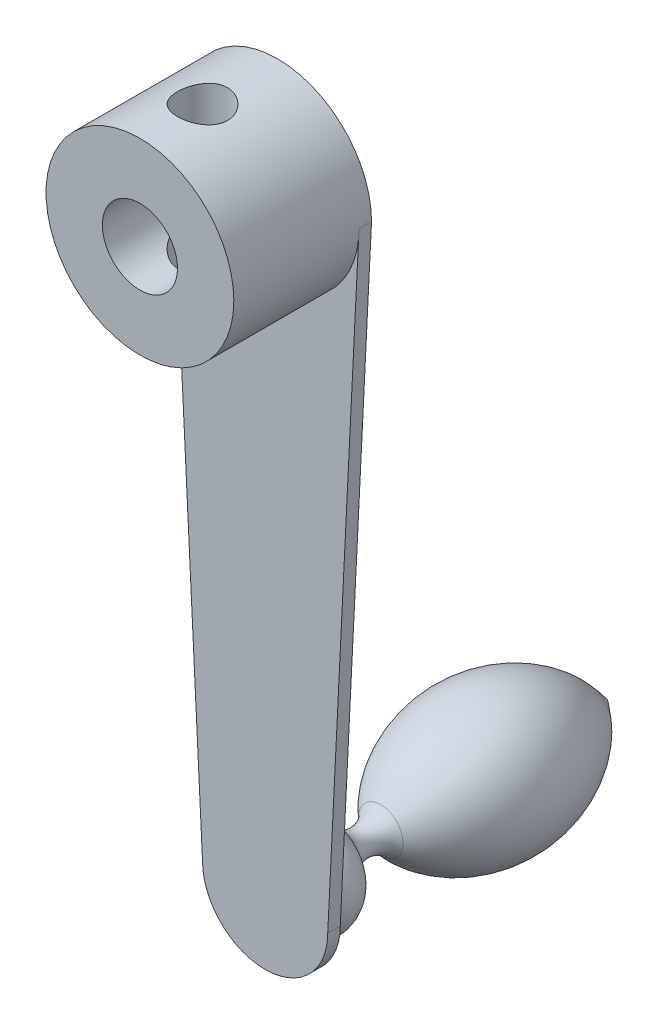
ISO-10303-21;
HEADER;
FILE_DESCRIPTION(('STEP AP214'),'2;1');
FILE_NAME('part.step','',(''),(''),'','','');
FILE_SCHEMA(('AUTOMOTIVE_DESIGN { 1 0 10303 214 1 1 1 1 }'));
ENDSEC;
DATA;
#1=APPLICATION_CONTEXT('core data for automotive mechanical design processes');
#2=APPLICATION_PROTOCOL_DEFINITION('international standard','automotive_design',2000,#1);
#3=PRODUCT_CONTEXT('',#1,'mechanical');
#4=PRODUCT('Part','Part','',(#3));
#5=PRODUCT_RELATED_PRODUCT_CATEGORY('part','',(#4));
#6=PRODUCT_DEFINITION_FORMATION('','',#4);
#7=PRODUCT_DEFINITION_CONTEXT('part definition',#1,'design');
#8=PRODUCT_DEFINITION('design','',#6,#7);
#9=PRODUCT_DEFINITION_SHAPE('','',#8);
#10=(LENGTH_UNIT() NAMED_UNIT(*) SI_UNIT(.MILLI.,.METRE.));
#11=(NAMED_UNIT(*) PLANE_ANGLE_UNIT() SI_UNIT($,.RADIAN.));
#12=(NAMED_UNIT(*) SI_UNIT($,.STERADIAN.) SOLID_ANGLE_UNIT());
#13=UNCERTAINTY_MEASURE_WITH_UNIT(LENGTH_MEASURE(1.E-05),#10,'distance_accuracy_value','');
#14=(GEOMETRIC_REPRESENTATION_CONTEXT(3) GLOBAL_UNCERTAINTY_ASSIGNED_CONTEXT((#13)) GLOBAL_UNIT_ASSIGNED_CONTEXT((#10,
#11,#12)) REPRESENTATION_CONTEXT('',''));
#15=CARTESIAN_POINT('',(0.,0.,0.));
#16=DIRECTION('',(0.,0.,1.));
#17=DIRECTION('',(1.,0.,0.));
#18=AXIS2_PLACEMENT_3D('',#15,#16,#17);
#19=CARTESIAN_POINT('',(0.,50.,0.));
#20=DIRECTION('',(0.,0.,1.));
#21=DIRECTION('',(1.,0.,0.));
#22=AXIS2_PLACEMENT_3D('',#19,#20,#21);
#23=PLANE('',#22);
#24=CARTESIAN_POINT('',(0.,50.,0.));
#25=DIRECTION('',(0.,0.,1.));
#26=DIRECTION('',(1.,0.,0.));
#27=AXIS2_PLACEMENT_3D('',#24,#25,#26);
#28=CIRCLE('',#27,3.);
#29=CARTESIAN_POINT('',(3.,50.,0.));
#30=VERTEX_POINT('',#29);
#31=EDGE_CURVE('E169',#30,#30,#28,.T.);
#32=ORIENTED_EDGE('',*,*,#31,.T.);
#33=EDGE_LOOP('',(#32));
#34=FACE_BOUND('',#33,.T.);
#35=CARTESIAN_POINT('',(0.,50.,0.));
#36=DIRECTION('',(0.,0.,1.));
#37=DIRECTION('',(1.,0.,0.));
#38=AXIS2_PLACEMENT_3D('',#35,#36,#37);
#39=CIRCLE('',#38,7.5);
#40=CARTESIAN_POINT('',(7.5,50.,0.));
#41=VERTEX_POINT('',#40);
#42=CARTESIAN_POINT('',(-7.5,50.,0.));
#43=VERTEX_POINT('',#42);
#44=EDGE_CURVE('E141',#41,#43,#39,.T.);
#45=ORIENTED_EDGE('',*,*,#44,.F.);
#46=DIRECTION('',(0.0499376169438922,0.998752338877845,0.));
#47=VECTOR('',#46,1.);
#48=CARTESIAN_POINT('',(7.5,50.,0.));
#49=LINE('',#48,#47);
#50=CARTESIAN_POINT('',(5.,0.,0.));
#51=VERTEX_POINT('',#50);
#52=EDGE_CURVE('E75',#51,#41,#49,.T.);
#53=ORIENTED_EDGE('',*,*,#52,.F.);
#54=CARTESIAN_POINT('',(0.,0.,0.));
#55=DIRECTION('',(0.,0.,1.));
#56=DIRECTION('',(1.,0.,0.));
#57=AXIS2_PLACEMENT_3D('',#54,#55,#56);
#58=CIRCLE('',#57,5.);
#59=CARTESIAN_POINT('',(-5.,0.,0.));
#60=VERTEX_POINT('',#59);
#61=EDGE_CURVE('E140',#60,#51,#58,.T.);
#62=ORIENTED_EDGE('',*,*,#61,.F.);
#63=DIRECTION('',(0.0499376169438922,-0.998752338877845,0.));
#64=VECTOR('',#63,1.);
#65=CARTESIAN_POINT('',(-7.5,50.,0.));
#66=LINE('',#65,#64);
#67=EDGE_CURVE('E132',#43,#60,#66,.T.);
#68=ORIENTED_EDGE('',*,*,#67,.F.);
#69=EDGE_LOOP('',(#45,#53,#62,#68));
#70=FACE_BOUND('',#69,.T.);
#71=CARTESIAN_POINT('',(0.,0.,0.));
#72=DIRECTION('',(0.,0.,1.));
#73=DIRECTION('',(1.,0.,0.));
#74=AXIS2_PLACEMENT_3D('',#71,#72,#73);
#75=CIRCLE('',#74,3.08331917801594);
#76=CARTESIAN_POINT('',(3.08331917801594,0.,0.));
#77=VERTEX_POINT('',#76);
#78=EDGE_CURVE('E11',#77,#77,#75,.F.);
#79=ORIENTED_EDGE('',*,*,#78,.F.);
#80=EDGE_LOOP('',(#79));
#81=FACE_BOUND('',#80,.T.);
#82=ADVANCED_FACE('F31',(#34,#70,#81),#23,.F.);
#83=CARTESIAN_POINT('',(0.,50.,1.));
#84=DIRECTION('',(0.,0.,-1.));
#85=DIRECTION('',(-1.,0.,0.));
#86=AXIS2_PLACEMENT_3D('',#83,#84,#85);
#87=CYLINDRICAL_SURFACE('',#86,7.5);
#88=CARTESIAN_POINT('',(0.,57.5,4.));
#89=CARTESIAN_POINT('',(-0.110254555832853,57.4999983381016,4.00000261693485));
#90=CARTESIAN_POINT('',(-0.220537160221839,57.4975448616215,4.00914761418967));
#91=CARTESIAN_POINT('',(-0.437925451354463,57.4879957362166,4.04542123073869));
#92=CARTESIAN_POINT('',(-0.545029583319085,57.4808978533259,4.07255850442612));
#93=CARTESIAN_POINT('',(-0.752891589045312,57.4628433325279,4.14387166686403));
#94=CARTESIAN_POINT('',(-0.853657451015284,57.4518916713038,4.18802558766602));
#95=CARTESIAN_POINT('',(-1.04635368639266,57.4272869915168,4.29203724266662));
#96=CARTESIAN_POINT('',(-1.13828347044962,57.4136337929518,4.35189602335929));
#97=CARTESIAN_POINT('',(-1.31282950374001,57.3847461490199,4.48708351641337));
#98=CARTESIAN_POINT('',(-1.39521168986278,57.3694846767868,4.56270866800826));
#99=CARTESIAN_POINT('',(-1.54628713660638,57.3392740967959,4.72664848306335));
#100=CARTESIAN_POINT('',(-1.61497863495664,57.3243250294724,4.81496477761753));
#101=CARTESIAN_POINT('',(-1.73786409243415,57.2961553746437,5.00364823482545));
#102=CARTESIAN_POINT('',(-1.79178877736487,57.2829688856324,5.10419632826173));
#103=CARTESIAN_POINT('',(-1.88187548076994,57.2602147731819,5.31334011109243));
#104=CARTESIAN_POINT('',(-1.91804077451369,57.2506464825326,5.42193431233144));
#105=CARTESIAN_POINT('',(-1.97076920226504,57.236491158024,5.64149553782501));
#106=CARTESIAN_POINT('',(-1.98775670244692,57.2317964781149,5.75235353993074));
#107=CARTESIAN_POINT('',(-2.0029703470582,57.2275983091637,5.97543768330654));
#108=CARTESIAN_POINT('',(-2.00119999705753,57.2280938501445,6.08766356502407));
#109=CARTESIAN_POINT('',(-1.97928510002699,57.2341237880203,6.30698541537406));
#110=CARTESIAN_POINT('',(-1.95965406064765,57.2395173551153,6.41413718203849));
#111=CARTESIAN_POINT('',(-1.90339748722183,57.2545101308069,6.62356833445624));
#112=CARTESIAN_POINT('',(-1.86677059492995,57.2641096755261,6.72584733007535));
#113=CARTESIAN_POINT('',(-1.77714356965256,57.2865566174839,6.92396814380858));
#114=CARTESIAN_POINT('',(-1.72396341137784,57.299439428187,7.01972433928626));
#115=CARTESIAN_POINT('',(-1.60286503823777,57.3269822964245,7.20113415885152));
#116=CARTESIAN_POINT('',(-1.53494392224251,57.3416427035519,7.28678578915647));
#117=CARTESIAN_POINT('',(-1.38366607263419,57.3716751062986,7.4484889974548));
#118=CARTESIAN_POINT('',(-1.29987812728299,57.3870547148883,7.52413631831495));
#119=CARTESIAN_POINT('',(-1.12061766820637,57.4163638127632,7.66038878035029));
#120=CARTESIAN_POINT('',(-1.02514469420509,57.4302932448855,7.72099332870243));
#121=CARTESIAN_POINT('',(-0.82459825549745,57.4552182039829,7.82561790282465));
#122=CARTESIAN_POINT('',(-0.719484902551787,57.4662007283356,7.86956477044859));
#123=CARTESIAN_POINT('',(-0.503002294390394,57.48390044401,7.93904718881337));
#124=CARTESIAN_POINT('',(-0.391634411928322,57.4906185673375,7.96458676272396));
#125=CARTESIAN_POINT('',(-0.169254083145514,57.4988915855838,7.99589487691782));
#126=CARTESIAN_POINT('',(-0.0583242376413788,57.5005899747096,8.00221303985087));
#127=CARTESIAN_POINT('',(0.1630100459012,57.4990447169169,7.99641683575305));
#128=CARTESIAN_POINT('',(0.273414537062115,57.4958015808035,7.98430437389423));
#129=CARTESIAN_POINT('',(0.488602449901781,57.4848303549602,7.94244155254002));
#130=CARTESIAN_POINT('',(0.593449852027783,57.4771802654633,7.91299775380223));
#131=CARTESIAN_POINT('',(0.796706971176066,57.4582629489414,7.83766405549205));
#132=CARTESIAN_POINT('',(0.895115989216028,57.4469953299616,7.79177237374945));
#133=CARTESIAN_POINT('',(1.08483847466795,57.4217566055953,7.68382611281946));
#134=CARTESIAN_POINT('',(1.17597518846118,57.4077368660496,7.62147253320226));
#135=CARTESIAN_POINT('',(1.34668463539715,57.3786145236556,7.48274836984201));
#136=CARTESIAN_POINT('',(1.42625507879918,57.3635117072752,7.40637501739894));
#137=CARTESIAN_POINT('',(1.57388924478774,57.333397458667,7.23921442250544));
#138=CARTESIAN_POINT('',(1.64156519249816,57.3184006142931,7.14808143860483));
#139=CARTESIAN_POINT('',(1.76067191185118,57.2906644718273,6.95543530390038));
#140=CARTESIAN_POINT('',(1.81210336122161,57.2779250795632,6.8539225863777));
#141=CARTESIAN_POINT('',(1.89687411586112,57.2562926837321,6.6439046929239));
#142=CARTESIAN_POINT('',(1.93031812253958,57.2473774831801,6.53544418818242));
#143=CARTESIAN_POINT('',(1.97841205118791,57.234398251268,6.31416068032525));
#144=CARTESIAN_POINT('',(1.99306677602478,57.2303329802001,6.20133879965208));
#145=CARTESIAN_POINT('',(2.00288989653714,57.2276174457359,5.9785052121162));
#146=CARTESIAN_POINT('',(1.99868155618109,57.2287939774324,5.86852267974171));
#147=CARTESIAN_POINT('',(1.97234376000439,57.2360239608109,5.65089648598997));
#148=CARTESIAN_POINT('',(1.95021476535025,57.2420772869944,5.54325276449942));
#149=CARTESIAN_POINT('',(1.88902515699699,57.2582757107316,5.33414424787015));
#150=CARTESIAN_POINT('',(1.8500966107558,57.2683888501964,5.23263815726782));
#151=CARTESIAN_POINT('',(1.75651554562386,57.2915681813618,5.03752116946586));
#152=CARTESIAN_POINT('',(1.70186056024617,57.3046348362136,4.94391151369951));
#153=CARTESIAN_POINT('',(1.57648909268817,57.3327292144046,4.76426964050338));
#154=CARTESIAN_POINT('',(1.50534729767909,57.3478033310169,4.67854146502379));
#155=CARTESIAN_POINT('',(1.349830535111,57.3779550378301,4.52003754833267));
#156=CARTESIAN_POINT('',(1.26545235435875,57.3930326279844,4.44726496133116));
#157=CARTESIAN_POINT('',(1.08367998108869,57.4218781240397,4.31520776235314));
#158=CARTESIAN_POINT('',(0.98604596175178,57.4356111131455,4.25624498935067));
#159=CARTESIAN_POINT('',(0.78188864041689,57.459838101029,4.15566258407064));
#160=CARTESIAN_POINT('',(0.675371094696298,57.4703341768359,4.1140318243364));
#161=CARTESIAN_POINT('',(0.474374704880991,57.4855475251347,4.05472471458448));
#162=CARTESIAN_POINT('',(0.380762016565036,57.490927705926,4.0342506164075));
#163=CARTESIAN_POINT('',(0.191439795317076,57.4981544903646,4.00688779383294));
#164=CARTESIAN_POINT('',(0.0957304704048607,57.5000014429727,3.99999772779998));
#165=CARTESIAN_POINT('',(0.,57.5,4.));
#166=B_SPLINE_CURVE_WITH_KNOTS('',3,(#88,#89,#90,#91,#92,#93,#94,#95,#96,#97,#98,#99,#100,#101,
#102,#103,#104,#105,#106,#107,#108,#109,#110,#111,#112,#113,#114,#115,#116,#117,#118,#119,#120,
#121,#122,#123,#124,#125,#126,#127,#128,#129,#130,#131,#132,#133,#134,#135,#136,#137,#138,#139,
#140,#141,#142,#143,#144,#145,#146,#147,#148,#149,#150,#151,#152,#153,#154,#155,#156,#157,#158,
#159,#160,#161,#162,#163,#164,#165),.UNSPECIFIED.,.T.,.F.,(4,2,2,2,2,2,2,2,2,2,2,2,2,2,2,2,2,2,
2,2,2,2,2,2,2,2,2,2,2,2,2,2,2,2,2,2,2,2,4),(0.,0.330412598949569,0.66098424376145,
0.991130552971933,1.32129886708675,1.65834897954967,1.99544244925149,2.33832582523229,
2.681145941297,3.01622158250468,3.3512346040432,3.67691002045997,4.0026114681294,
4.33198673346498,4.6614268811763,5.00161259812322,5.34181171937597,5.68348809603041,
6.02508977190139,6.35682717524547,6.68853028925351,7.01453535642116,7.34057575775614,
7.6730028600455,8.00549568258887,8.34736496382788,8.68921998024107,9.02906297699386,
9.36881908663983,9.69743342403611,10.0260393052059,10.352107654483,10.67822717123,
11.0139433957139,11.3497412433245,11.692722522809,12.0354832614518,12.3223981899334,
12.6092847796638),.UNSPECIFIED.);
#167=CARTESIAN_POINT('',(0.,57.5,4.));
#168=VERTEX_POINT('',#167);
#169=EDGE_CURVE('E173',#168,#168,#166,.T.);
#170=ORIENTED_EDGE('',*,*,#169,.F.);
#171=EDGE_LOOP('',(#170));
#172=FACE_BOUND('',#171,.T.);
#173=CARTESIAN_POINT('',(0.,50.,11.));
#174=DIRECTION('',(0.,0.,1.));
#175=DIRECTION('',(1.,0.,0.));
#176=AXIS2_PLACEMENT_3D('',#173,#174,#175);
#177=CIRCLE('',#176,7.5);
#178=CARTESIAN_POINT('',(7.5,50.,11.));
#179=VERTEX_POINT('',#178);
#180=EDGE_CURVE('E166',#179,#179,#177,.T.);
#181=ORIENTED_EDGE('',*,*,#180,.F.);
#182=EDGE_LOOP('',(#181));
#183=FACE_BOUND('',#182,.T.);
#184=ORIENTED_EDGE('',*,*,#44,.T.);
#185=DIRECTION('',(0.,0.,-1.));
#186=VECTOR('',#185,1.);
#187=CARTESIAN_POINT('',(-7.5,50.,1.));
#188=LINE('',#187,#186);
#189=CARTESIAN_POINT('',(-7.5,50.,1.));
#190=VERTEX_POINT('',#189);
#191=EDGE_CURVE('E136',#190,#43,#188,.T.);
#192=ORIENTED_EDGE('',*,*,#191,.F.);
#193=CARTESIAN_POINT('',(0.,50.,1.));
#194=DIRECTION('',(0.,0.,1.));
#195=DIRECTION('',(1.,0.,0.));
#196=AXIS2_PLACEMENT_3D('',#193,#194,#195);
#197=CIRCLE('',#196,7.5);
#198=CARTESIAN_POINT('',(-7.46259351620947,49.2518703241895,1.));
#199=VERTEX_POINT('',#198);
#200=EDGE_CURVE('E163',#190,#199,#197,.T.);
#201=ORIENTED_EDGE('',*,*,#200,.T.);
#202=CARTESIAN_POINT('',(7.46259351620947,49.2518703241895,1.));
#203=VERTEX_POINT('',#202);
#204=EDGE_CURVE('E40',#199,#203,#197,.T.);
#205=ORIENTED_EDGE('',*,*,#204,.T.);
#206=CARTESIAN_POINT('',(7.5,50.,1.));
#207=VERTEX_POINT('',#206);
#208=EDGE_CURVE('E160',#203,#207,#197,.T.);
#209=ORIENTED_EDGE('',*,*,#208,.T.);
#210=DIRECTION('',(0.,0.,-1.));
#211=VECTOR('',#210,1.);
#212=CARTESIAN_POINT('',(7.5,50.,1.));
#213=LINE('',#212,#211);
#214=EDGE_CURVE('E55',#207,#41,#213,.T.);
#215=ORIENTED_EDGE('',*,*,#214,.T.);
#216=EDGE_LOOP('',(#184,#192,#201,#205,#209,#215));
#217=FACE_BOUND('',#216,.T.);
#218=CARTESIAN_POINT('',(0.,42.5,4.));
#219=CARTESIAN_POINT('',(0.110254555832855,42.5000016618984,4.00000261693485));
#220=CARTESIAN_POINT('',(0.220537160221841,42.5024551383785,4.00914761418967));
#221=CARTESIAN_POINT('',(0.437925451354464,42.5120042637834,4.04542123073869));
#222=CARTESIAN_POINT('',(0.545029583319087,42.5191021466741,4.07255850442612));
#223=CARTESIAN_POINT('',(0.752891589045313,42.5371566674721,4.14387166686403));
#224=CARTESIAN_POINT('',(0.853657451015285,42.5481083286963,4.18802558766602));
#225=CARTESIAN_POINT('',(1.04635368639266,42.5727130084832,4.29203724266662));
#226=CARTESIAN_POINT('',(1.13828347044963,42.5863662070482,4.35189602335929));
#227=CARTESIAN_POINT('',(1.31282950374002,42.6152538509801,4.48708351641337));
#228=CARTESIAN_POINT('',(1.39521168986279,42.6305153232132,4.56270866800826));
#229=CARTESIAN_POINT('',(1.54628713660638,42.6607259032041,4.72664848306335));
#230=CARTESIAN_POINT('',(1.61497863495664,42.6756749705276,4.81496477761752));
#231=CARTESIAN_POINT('',(1.73786409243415,42.7038446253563,5.00364823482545));
#232=CARTESIAN_POINT('',(1.79178877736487,42.7170311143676,5.10419632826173));
#233=CARTESIAN_POINT('',(1.88187548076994,42.7397852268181,5.31334011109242));
#234=CARTESIAN_POINT('',(1.91804077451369,42.7493535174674,5.42193431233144));
#235=CARTESIAN_POINT('',(1.97076920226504,42.763508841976,5.64149553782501));
#236=CARTESIAN_POINT('',(1.98775670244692,42.7682035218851,5.75235353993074));
#237=CARTESIAN_POINT('',(2.0029703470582,42.7724016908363,5.97543768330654));
#238=CARTESIAN_POINT('',(2.00119999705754,42.7719061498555,6.08766356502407));
#239=CARTESIAN_POINT('',(1.97928510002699,42.7658762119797,6.30698541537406));
#240=CARTESIAN_POINT('',(1.95965406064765,42.7604826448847,6.41413718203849));
#241=CARTESIAN_POINT('',(1.90339748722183,42.7454898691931,6.62356833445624));
#242=CARTESIAN_POINT('',(1.86677059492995,42.7358903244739,6.72584733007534));
#243=CARTESIAN_POINT('',(1.77714356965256,42.7134433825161,6.92396814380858));
#244=CARTESIAN_POINT('',(1.72396341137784,42.700560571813,7.01972433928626));
#245=CARTESIAN_POINT('',(1.60286503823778,42.6730177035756,7.20113415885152));
#246=CARTESIAN_POINT('',(1.53494392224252,42.6583572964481,7.28678578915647));
#247=CARTESIAN_POINT('',(1.38366607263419,42.6283248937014,7.4484889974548));
#248=CARTESIAN_POINT('',(1.29987812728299,42.6129452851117,7.52413631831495));
#249=CARTESIAN_POINT('',(1.12061766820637,42.5836361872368,7.66038878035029));
#250=CARTESIAN_POINT('',(1.02514469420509,42.5697067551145,7.72099332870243));
#251=CARTESIAN_POINT('',(0.824598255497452,42.5447817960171,7.82561790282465));
#252=CARTESIAN_POINT('',(0.719484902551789,42.5337992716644,7.86956477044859));
#253=CARTESIAN_POINT('',(0.503002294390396,42.51609955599,7.93904718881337));
#254=CARTESIAN_POINT('',(0.391634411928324,42.5093814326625,7.96458676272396));
#255=CARTESIAN_POINT('',(0.169254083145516,42.5011084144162,7.99589487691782));
#256=CARTESIAN_POINT('',(0.0583242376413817,42.4994100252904,8.00221303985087));
#257=CARTESIAN_POINT('',(-0.163010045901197,42.5009552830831,7.99641683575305));
#258=CARTESIAN_POINT('',(-0.273414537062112,42.5041984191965,7.98430437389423));
#259=CARTESIAN_POINT('',(-0.488602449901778,42.5151696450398,7.94244155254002));
#260=CARTESIAN_POINT('',(-0.59344985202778,42.5228197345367,7.91299775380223));
#261=CARTESIAN_POINT('',(-0.796706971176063,42.5417370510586,7.83766405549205));
#262=CARTESIAN_POINT('',(-0.895115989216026,42.5530046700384,7.79177237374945));
#263=CARTESIAN_POINT('',(-1.08483847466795,42.5782433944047,7.68382611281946));
#264=CARTESIAN_POINT('',(-1.17597518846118,42.5922631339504,7.62147253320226));
#265=CARTESIAN_POINT('',(-1.34668463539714,42.6213854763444,7.48274836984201));
#266=CARTESIAN_POINT('',(-1.42625507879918,42.6364882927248,7.40637501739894));
#267=CARTESIAN_POINT('',(-1.57388924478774,42.666602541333,7.23921442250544));
#268=CARTESIAN_POINT('',(-1.64156519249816,42.6815993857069,7.14808143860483));
#269=CARTESIAN_POINT('',(-1.76067191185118,42.7093355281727,6.95543530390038));
#270=CARTESIAN_POINT('',(-1.81210336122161,42.7220749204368,6.8539225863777));
#271=CARTESIAN_POINT('',(-1.89687411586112,42.7437073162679,6.6439046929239));
#272=CARTESIAN_POINT('',(-1.93031812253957,42.7526225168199,6.53544418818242));
#273=CARTESIAN_POINT('',(-1.97841205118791,42.765601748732,6.31416068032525));
#274=CARTESIAN_POINT('',(-1.99306677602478,42.7696670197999,6.20133879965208));
#275=CARTESIAN_POINT('',(-2.00288989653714,42.7723825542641,5.9785052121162));
#276=CARTESIAN_POINT('',(-1.99868155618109,42.7712060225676,5.86852267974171));
#277=CARTESIAN_POINT('',(-1.97234376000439,42.7639760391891,5.65089648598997));
#278=CARTESIAN_POINT('',(-1.95021476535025,42.7579227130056,5.54325276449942));
#279=CARTESIAN_POINT('',(-1.88902515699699,42.7417242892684,5.33414424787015));
#280=CARTESIAN_POINT('',(-1.8500966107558,42.7316111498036,5.23263815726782));
#281=CARTESIAN_POINT('',(-1.75651554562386,42.7084318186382,5.03752116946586));
#282=CARTESIAN_POINT('',(-1.70186056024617,42.6953651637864,4.94391151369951));
#283=CARTESIAN_POINT('',(-1.57648909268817,42.6672707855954,4.76426964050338));
#284=CARTESIAN_POINT('',(-1.50534729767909,42.6521966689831,4.67854146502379));
#285=CARTESIAN_POINT('',(-1.349830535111,42.6220449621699,4.52003754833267));
#286=CARTESIAN_POINT('',(-1.26545235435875,42.6069673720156,4.44726496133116));
#287=CARTESIAN_POINT('',(-1.08367998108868,42.5781218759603,4.31520776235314));
#288=CARTESIAN_POINT('',(-0.986045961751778,42.5643888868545,4.25624498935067));
#289=CARTESIAN_POINT('',(-0.781888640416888,42.540161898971,4.15566258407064));
#290=CARTESIAN_POINT('',(-0.675371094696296,42.5296658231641,4.1140318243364));
#291=CARTESIAN_POINT('',(-0.47437470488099,42.5144524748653,4.05472471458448));
#292=CARTESIAN_POINT('',(-0.380762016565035,42.509072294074,4.0342506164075));
#293=CARTESIAN_POINT('',(-0.191439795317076,42.5018455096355,4.00688779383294));
#294=CARTESIAN_POINT('',(-0.0957304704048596,42.4999985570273,3.99999772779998));
#295=CARTESIAN_POINT('',(0.,42.5,4.));
#296=B_SPLINE_CURVE_WITH_KNOTS('',3,(#218,#219,#220,#221,#222,#223,#224,#225,#226,#227,#228,
#229,#230,#231,#232,#233,#234,#235,#236,#237,#238,#239,#240,#241,#242,#243,#244,#245,#246,#247,
#248,#249,#250,#251,#252,#253,#254,#255,#256,#257,#258,#259,#260,#261,#262,#263,#264,#265,#266,
#267,#268,#269,#270,#271,#272,#273,#274,#275,#276,#277,#278,#279,#280,#281,#282,#283,#284,#285,
#286,#287,#288,#289,#290,#291,#292,#293,#294,#295),.UNSPECIFIED.,.T.,.F.,(4,2,2,2,2,2,2,2,2,2,2,
2,2,2,2,2,2,2,2,2,2,2,2,2,2,2,2,2,2,2,2,2,2,2,2,2,2,2,4),(0.,0.330412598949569,0.66098424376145,
0.991130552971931,1.32129886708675,1.65834897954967,1.99544244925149,2.33832582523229,
2.681145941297,3.01622158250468,3.3512346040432,3.67691002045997,4.00261146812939,
4.33198673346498,4.6614268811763,5.00161259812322,5.34181171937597,5.68348809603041,
6.02508977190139,6.35682717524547,6.68853028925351,7.01453535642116,7.34057575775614,
7.6730028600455,8.00549568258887,8.34736496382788,8.68921998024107,9.02906297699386,
9.36881908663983,9.69743342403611,10.0260393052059,10.352107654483,10.67822717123,
11.0139433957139,11.3497412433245,11.692722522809,12.0354832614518,12.3223981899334,
12.6092847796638),.UNSPECIFIED.);
#297=CARTESIAN_POINT('',(0.,42.5,4.));
#298=VERTEX_POINT('',#297);
#299=EDGE_CURVE('E178',#298,#298,#296,.T.);
#300=ORIENTED_EDGE('',*,*,#299,.F.);
#301=EDGE_LOOP('',(#300));
#302=FACE_BOUND('',#301,.T.);
#303=ADVANCED_FACE('F33',(#172,#183,#217,#302),#87,.T.);
#304=CARTESIAN_POINT('',(0.,50.,1.));
#305=DIRECTION('',(0.,0.,-1.));
#306=DIRECTION('',(-1.,0.,0.));
#307=AXIS2_PLACEMENT_3D('',#304,#305,#306);
#308=CYLINDRICAL_SURFACE('',#307,3.);
#309=CARTESIAN_POINT('',(0.,47.,4.));
#310=CARTESIAN_POINT('',(0.100484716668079,46.9999995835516,3.99999945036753));
#311=CARTESIAN_POINT('',(0.200969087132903,47.0050919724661,4.0076139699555));
#312=CARTESIAN_POINT('',(0.398733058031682,47.0249534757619,4.03759686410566));
#313=CARTESIAN_POINT('',(0.496011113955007,47.0397271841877,4.05997224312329));
#314=CARTESIAN_POINT('',(0.68421230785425,47.0774951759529,4.11810771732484));
#315=CARTESIAN_POINT('',(0.775162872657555,47.1004509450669,4.15380514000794));
#316=CARTESIAN_POINT('',(0.949415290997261,47.1527386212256,4.2370633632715));
#317=CARTESIAN_POINT('',(1.03271603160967,47.1820714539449,4.28462588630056));
#318=CARTESIAN_POINT('',(1.19728470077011,47.2477267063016,4.39465693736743));
#319=CARTESIAN_POINT('',(1.27778030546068,47.2844310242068,4.45804786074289));
#320=CARTESIAN_POINT('',(1.42772804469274,47.3601768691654,4.59573004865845));
#321=CARTESIAN_POINT('',(1.49716405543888,47.3992216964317,4.67003692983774));
#322=CARTESIAN_POINT('',(1.63422297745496,47.4827173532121,4.84105236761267));
#323=CARTESIAN_POINT('',(1.6998318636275,47.5270493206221,4.93944565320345));
#324=CARTESIAN_POINT('',(1.81350357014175,47.6091585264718,5.14836337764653));
#325=CARTESIAN_POINT('',(1.86159673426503,47.6469470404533,5.25886640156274));
#326=CARTESIAN_POINT('',(1.92674035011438,47.7002373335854,5.45671129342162));
#327=CARTESIAN_POINT('',(1.94874447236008,47.719023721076,5.5415284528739));
#328=CARTESIAN_POINT('',(1.98150617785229,47.747420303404,5.71474450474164));
#329=CARTESIAN_POINT('',(1.99228314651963,47.7570463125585,5.80313694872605));
#330=CARTESIAN_POINT('',(2.00191364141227,47.7656339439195,5.98147477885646));
#331=CARTESIAN_POINT('',(2.00071842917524,47.764551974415,6.07142502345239));
#332=CARTESIAN_POINT('',(1.98637581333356,47.7518022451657,6.24963497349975));
#333=CARTESIAN_POINT('',(1.97321828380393,47.7401255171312,6.33789318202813));
#334=CARTESIAN_POINT('',(1.93664994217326,47.7087281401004,6.50646705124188));
#335=CARTESIAN_POINT('',(1.91371711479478,47.6893851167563,6.58696133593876));
#336=CARTESIAN_POINT('',(1.85870118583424,47.6449037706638,6.74302369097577));
#337=CARTESIAN_POINT('',(1.82661507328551,47.6197635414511,6.81859013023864));
#338=CARTESIAN_POINT('',(1.74673818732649,47.5603580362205,6.97902539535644));
#339=CARTESIAN_POINT('',(1.69708052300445,47.5252768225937,7.06265990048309));
#340=CARTESIAN_POINT('',(1.58668960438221,47.4530846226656,7.22138339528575));
#341=CARTESIAN_POINT('',(1.52594268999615,47.4159711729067,7.29646165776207));
#342=CARTESIAN_POINT('',(1.37981165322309,47.3345665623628,7.45254254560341));
#343=CARTESIAN_POINT('',(1.29193938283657,47.2904525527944,7.53133404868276));
#344=CARTESIAN_POINT('',(1.10200799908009,47.2078189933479,7.67319649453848));
#345=CARTESIAN_POINT('',(0.999962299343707,47.1692942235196,7.73628214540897));
#346=CARTESIAN_POINT('',(0.804857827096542,47.1085459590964,7.83347771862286));
#347=CARTESIAN_POINT('',(0.713957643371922,47.0846073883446,7.87084336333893));
#348=CARTESIAN_POINT('',(0.526036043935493,47.044922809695,7.93210492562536));
#349=CARTESIAN_POINT('',(0.429019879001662,47.0291698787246,7.95601222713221));
#350=CARTESIAN_POINT('',(0.230985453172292,47.0072411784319,7.98916116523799));
#351=CARTESIAN_POINT('',(0.129951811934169,47.0011067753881,7.99833946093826));
#352=CARTESIAN_POINT('',(-0.0724415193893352,46.9991688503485,8.0012470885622));
#353=CARTESIAN_POINT('',(-0.173801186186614,47.0033646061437,7.99497750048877));
#354=CARTESIAN_POINT('',(-0.366455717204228,47.0210041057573,7.96837594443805));
#355=CARTESIAN_POINT('',(-0.457957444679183,47.0337775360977,7.94906270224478));
#356=CARTESIAN_POINT('',(-0.636116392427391,47.0668155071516,7.89840431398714));
#357=CARTESIAN_POINT('',(-0.722772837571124,47.0870812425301,7.86705724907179));
#358=CARTESIAN_POINT('',(-0.894664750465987,47.1350364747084,7.79134770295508));
#359=CARTESIAN_POINT('',(-0.979496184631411,47.1631012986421,7.74631184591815));
#360=CARTESIAN_POINT('',(-1.14068302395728,47.2239814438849,7.64556671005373));
#361=CARTESIAN_POINT('',(-1.2170331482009,47.2567996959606,7.58985083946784));
#362=CARTESIAN_POINT('',(-1.37185445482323,47.3304545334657,7.4593921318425));
#363=CARTESIAN_POINT('',(-1.44875187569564,47.3717384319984,7.38303373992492));
#364=CARTESIAN_POINT('',(-1.58933968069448,47.4542882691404,7.21888857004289));
#365=CARTESIAN_POINT('',(-1.65302093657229,47.4955541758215,7.1310939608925));
#366=CARTESIAN_POINT('',(-1.76124776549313,47.5706032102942,6.95285758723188));
#367=CARTESIAN_POINT('',(-1.80695636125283,47.604724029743,6.8632679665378));
#368=CARTESIAN_POINT('',(-1.88496213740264,47.6656102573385,6.67612734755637));
#369=CARTESIAN_POINT('',(-1.91728345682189,47.6923888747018,6.57859106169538));
#370=CARTESIAN_POINT('',(-1.9623584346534,47.7306679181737,6.39543551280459));
#371=CARTESIAN_POINT('',(-1.97758597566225,47.7440500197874,6.310828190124));
#372=CARTESIAN_POINT('',(-1.99699205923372,47.761205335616,6.13942671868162));
#373=CARTESIAN_POINT('',(-2.00118260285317,47.7649889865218,6.05263504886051));
#374=CARTESIAN_POINT('',(-1.99823921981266,47.7623579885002,5.87935694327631));
#375=CARTESIAN_POINT('',(-1.99109858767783,47.7559373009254,5.79287071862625));
#376=CARTESIAN_POINT('',(-1.96596997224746,47.7338954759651,5.62265647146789));
#377=CARTESIAN_POINT('',(-1.94796751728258,47.7182620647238,5.53893228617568));
#378=CARTESIAN_POINT('',(-1.89593035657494,47.674731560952,5.35428881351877));
#379=CARTESIAN_POINT('',(-1.85890187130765,47.6446766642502,5.25473228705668));
#380=CARTESIAN_POINT('',(-1.77084526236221,47.5777783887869,5.0645131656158));
#381=CARTESIAN_POINT('',(-1.7197974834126,47.540925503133,4.97386330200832));
#382=CARTESIAN_POINT('',(-1.60398280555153,47.4638281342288,4.80071811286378));
#383=CARTESIAN_POINT('',(-1.53898309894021,47.4235341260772,4.71840125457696));
#384=CARTESIAN_POINT('',(-1.39671768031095,47.3437169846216,4.56467752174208));
#385=CARTESIAN_POINT('',(-1.3194482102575,47.304194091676,4.4932740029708));
#386=CARTESIAN_POINT('',(-1.14145732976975,47.2236844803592,4.35328789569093));
#387=CARTESIAN_POINT('',(-1.03896166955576,47.1833019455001,4.28658135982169));
#388=CARTESIAN_POINT('',(-0.820868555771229,47.1122233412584,4.1720867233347));
#389=CARTESIAN_POINT('',(-0.705292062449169,47.0815120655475,4.12426889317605));
#390=CARTESIAN_POINT('',(-0.491435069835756,47.0389835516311,4.05884542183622));
#391=CARTESIAN_POINT('',(-0.395012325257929,47.0244851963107,4.03688896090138));
#392=CARTESIAN_POINT('',(-0.199058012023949,47.0049971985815,4.0074719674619));
#393=CARTESIAN_POINT('',(-0.0995288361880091,47.0000004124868,4.00000054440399));
#394=CARTESIAN_POINT('',(0.,47.,4.));
#395=B_SPLINE_CURVE_WITH_KNOTS('',3,(#309,#310,#311,#312,#313,#314,#315,#316,#317,#318,#319,
#320,#321,#322,#323,#324,#325,#326,#327,#328,#329,#330,#331,#332,#333,#334,#335,#336,#337,#338,
#339,#340,#341,#342,#343,#344,#345,#346,#347,#348,#349,#350,#351,#352,#353,#354,#355,#356,#357,
#358,#359,#360,#361,#362,#363,#364,#365,#366,#367,#368,#369,#370,#371,#372,#373,#374,#375,#376,
#377,#378,#379,#380,#381,#382,#383,#384,#385,#386,#387,#388,#389,#390,#391,#392,#393,#394),
.UNSPECIFIED.,.T.,.F.,(4,2,2,2,2,2,2,2,2,2,2,2,2,2,2,2,2,2,2,2,2,2,2,2,2,2,2,2,2,2,2,2,2,2,2,2,
2,2,2,2,2,2,4),(0.,0.3010532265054,0.602249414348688,0.902046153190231,1.20188643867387,
1.52717029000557,1.85292411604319,2.23006683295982,2.60655305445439,2.87433693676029,
3.14165767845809,3.41006711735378,3.67870397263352,3.93548862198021,4.19235783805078,
4.50147574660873,4.81097703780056,5.18718954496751,5.56304840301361,5.86524087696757,
6.16717735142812,6.4704088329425,6.77361911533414,7.05553084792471,7.33748755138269,
7.63652346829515,7.93574454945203,8.2822817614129,8.62905753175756,8.94649935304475,
9.26336626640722,9.52324048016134,9.7828320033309,10.0425772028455,10.302669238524,
10.6320660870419,10.9619271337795,11.2977924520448,11.6337608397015,12.0179535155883,
12.4015390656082,12.6999529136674,12.9981423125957),.UNSPECIFIED.);
#396=CARTESIAN_POINT('',(0.,47.,4.));
#397=VERTEX_POINT('',#396);
#398=EDGE_CURVE('E189',#397,#397,#395,.T.);
#399=ORIENTED_EDGE('',*,*,#398,.T.);
#400=EDGE_LOOP('',(#399));
#401=FACE_BOUND('',#400,.T.);
#402=ORIENTED_EDGE('',*,*,#31,.F.);
#403=EDGE_LOOP('',(#402));
#404=FACE_BOUND('',#403,.T.);
#405=CARTESIAN_POINT('',(0.,50.,11.));
#406=DIRECTION('',(0.,0.,1.));
#407=DIRECTION('',(1.,0.,0.));
#408=AXIS2_PLACEMENT_3D('',#405,#406,#407);
#409=CIRCLE('',#408,3.);
#410=CARTESIAN_POINT('',(3.,50.,11.));
#411=VERTEX_POINT('',#410);
#412=EDGE_CURVE('E170',#411,#411,#409,.T.);
#413=ORIENTED_EDGE('',*,*,#412,.T.);
#414=EDGE_LOOP('',(#413));
#415=FACE_BOUND('',#414,.T.);
#416=CARTESIAN_POINT('',(0.,53.,4.));
#417=CARTESIAN_POINT('',(-0.100484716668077,53.0000004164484,3.99999945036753));
#418=CARTESIAN_POINT('',(-0.200969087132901,52.9949080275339,4.0076139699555));
#419=CARTESIAN_POINT('',(-0.39873305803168,52.9750465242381,4.03759686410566));
#420=CARTESIAN_POINT('',(-0.496011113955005,52.9602728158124,4.05997224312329));
#421=CARTESIAN_POINT('',(-0.684212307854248,52.9225048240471,4.11810771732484));
#422=CARTESIAN_POINT('',(-0.775162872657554,52.8995490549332,4.15380514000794));
#423=CARTESIAN_POINT('',(-0.94941529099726,52.8472613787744,4.2370633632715));
#424=CARTESIAN_POINT('',(-1.03271603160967,52.8179285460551,4.28462588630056));
#425=CARTESIAN_POINT('',(-1.19728470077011,52.7522732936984,4.39465693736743));
#426=CARTESIAN_POINT('',(-1.27778030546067,52.7155689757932,4.45804786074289));
#427=CARTESIAN_POINT('',(-1.42772804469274,52.6398231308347,4.59573004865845));
#428=CARTESIAN_POINT('',(-1.49716405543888,52.6007783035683,4.67003692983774));
#429=CARTESIAN_POINT('',(-1.63422297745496,52.5172826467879,4.84105236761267));
#430=CARTESIAN_POINT('',(-1.6998318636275,52.472950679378,4.93944565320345));
#431=CARTESIAN_POINT('',(-1.81350357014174,52.3908414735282,5.14836337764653));
#432=CARTESIAN_POINT('',(-1.86159673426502,52.3530529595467,5.25886640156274));
#433=CARTESIAN_POINT('',(-1.92674035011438,52.2997626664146,5.45671129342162));
#434=CARTESIAN_POINT('',(-1.94874447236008,52.280976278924,5.5415284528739));
#435=CARTESIAN_POINT('',(-1.98150617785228,52.252579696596,5.71474450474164));
#436=CARTESIAN_POINT('',(-1.99228314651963,52.2429536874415,5.80313694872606));
#437=CARTESIAN_POINT('',(-2.00191364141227,52.2343660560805,5.98147477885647));
#438=CARTESIAN_POINT('',(-2.00071842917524,52.235448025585,6.0714250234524));
#439=CARTESIAN_POINT('',(-1.98637581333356,52.2481977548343,6.24963497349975));
#440=CARTESIAN_POINT('',(-1.97321828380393,52.2598744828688,6.33789318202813));
#441=CARTESIAN_POINT('',(-1.93664994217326,52.2912718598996,6.50646705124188));
#442=CARTESIAN_POINT('',(-1.91371711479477,52.3106148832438,6.58696133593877));
#443=CARTESIAN_POINT('',(-1.85870118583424,52.3550962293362,6.74302369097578));
#444=CARTESIAN_POINT('',(-1.8266150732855,52.3802364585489,6.81859013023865));
#445=CARTESIAN_POINT('',(-1.74673818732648,52.4396419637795,6.97902539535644));
#446=CARTESIAN_POINT('',(-1.69708052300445,52.4747231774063,7.06265990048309));
#447=CARTESIAN_POINT('',(-1.58668960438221,52.5469153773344,7.22138339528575));
#448=CARTESIAN_POINT('',(-1.52594268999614,52.5840288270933,7.29646165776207));
#449=CARTESIAN_POINT('',(-1.37981165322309,52.6654334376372,7.45254254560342));
#450=CARTESIAN_POINT('',(-1.29193938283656,52.7095474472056,7.53133404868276));
#451=CARTESIAN_POINT('',(-1.10200799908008,52.7921810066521,7.67319649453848));
#452=CARTESIAN_POINT('',(-0.999962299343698,52.8307057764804,7.73628214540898));
#453=CARTESIAN_POINT('',(-0.80485782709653,52.8914540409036,7.83347771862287));
#454=CARTESIAN_POINT('',(-0.713957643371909,52.9153926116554,7.87084336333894));
#455=CARTESIAN_POINT('',(-0.526036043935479,52.955077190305,7.93210492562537));
#456=CARTESIAN_POINT('',(-0.429019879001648,52.9708301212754,7.95601222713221));
#457=CARTESIAN_POINT('',(-0.230985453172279,52.9927588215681,7.989161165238));
#458=CARTESIAN_POINT('',(-0.129951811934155,52.9988932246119,7.99833946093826));
#459=CARTESIAN_POINT('',(0.0724415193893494,53.0008311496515,8.00124708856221));
#460=CARTESIAN_POINT('',(0.173801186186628,52.9966353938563,7.99497750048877));
#461=CARTESIAN_POINT('',(0.366455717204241,52.9789958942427,7.96837594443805));
#462=CARTESIAN_POINT('',(0.457957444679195,52.9662224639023,7.94906270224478));
#463=CARTESIAN_POINT('',(0.636116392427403,52.9331844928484,7.89840431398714));
#464=CARTESIAN_POINT('',(0.722772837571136,52.9129187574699,7.86705724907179));
#465=CARTESIAN_POINT('',(0.894664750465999,52.8649635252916,7.79134770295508));
#466=CARTESIAN_POINT('',(0.97949618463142,52.8368987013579,7.74631184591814));
#467=CARTESIAN_POINT('',(1.14068302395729,52.7760185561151,7.64556671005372));
#468=CARTESIAN_POINT('',(1.21703314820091,52.7432003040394,7.58985083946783));
#469=CARTESIAN_POINT('',(1.37185445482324,52.6695454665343,7.45939213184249));
#470=CARTESIAN_POINT('',(1.44875187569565,52.6282615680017,7.38303373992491));
#471=CARTESIAN_POINT('',(1.58933968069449,52.5457117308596,7.21888857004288));
#472=CARTESIAN_POINT('',(1.6530209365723,52.5044458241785,7.13109396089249));
#473=CARTESIAN_POINT('',(1.76124776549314,52.4293967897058,6.95285758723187));
#474=CARTESIAN_POINT('',(1.80695636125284,52.395275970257,6.86326796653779));
#475=CARTESIAN_POINT('',(1.88496213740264,52.3343897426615,6.67612734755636));
#476=CARTESIAN_POINT('',(1.91728345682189,52.3076111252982,6.57859106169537));
#477=CARTESIAN_POINT('',(1.9623584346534,52.2693320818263,6.39543551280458));
#478=CARTESIAN_POINT('',(1.97758597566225,52.2559499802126,6.31082819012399));
#479=CARTESIAN_POINT('',(1.99699205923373,52.238794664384,6.13942671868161));
#480=CARTESIAN_POINT('',(2.00118260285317,52.2350110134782,6.0526350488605));
#481=CARTESIAN_POINT('',(1.99823921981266,52.2376420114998,5.8793569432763));
#482=CARTESIAN_POINT('',(1.99109858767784,52.2440626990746,5.79287071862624));
#483=CARTESIAN_POINT('',(1.96596997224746,52.2661045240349,5.62265647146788));
#484=CARTESIAN_POINT('',(1.94796751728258,52.2817379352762,5.53893228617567));
#485=CARTESIAN_POINT('',(1.89593035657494,52.325268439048,5.35428881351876));
#486=CARTESIAN_POINT('',(1.85890187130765,52.3553233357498,5.25473228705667));
#487=CARTESIAN_POINT('',(1.77084526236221,52.4222216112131,5.06451316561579));
#488=CARTESIAN_POINT('',(1.71979748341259,52.459074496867,4.97386330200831));
#489=CARTESIAN_POINT('',(1.60398280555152,52.5361718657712,4.80071811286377));
#490=CARTESIAN_POINT('',(1.5389830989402,52.5764658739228,4.71840125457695));
#491=CARTESIAN_POINT('',(1.39671768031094,52.6562830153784,4.56467752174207));
#492=CARTESIAN_POINT('',(1.31944821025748,52.695805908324,4.49327400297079));
#493=CARTESIAN_POINT('',(1.14145732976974,52.7763155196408,4.35328789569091));
#494=CARTESIAN_POINT('',(1.03896166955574,52.8166980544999,4.28658135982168));
#495=CARTESIAN_POINT('',(0.820868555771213,52.8877766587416,4.1720867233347));
#496=CARTESIAN_POINT('',(0.705292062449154,52.9184879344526,4.12426889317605));
#497=CARTESIAN_POINT('',(0.491435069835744,52.961016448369,4.05884542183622));
#498=CARTESIAN_POINT('',(0.39501232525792,52.9755148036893,4.03688896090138));
#499=CARTESIAN_POINT('',(0.199058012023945,52.9950028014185,4.0074719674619));
#500=CARTESIAN_POINT('',(0.099528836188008,52.9999995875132,4.00000054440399));
#501=CARTESIAN_POINT('',(0.,53.,4.));
#502=B_SPLINE_CURVE_WITH_KNOTS('',3,(#416,#417,#418,#419,#420,#421,#422,#423,#424,#425,#426,
#427,#428,#429,#430,#431,#432,#433,#434,#435,#436,#437,#438,#439,#440,#441,#442,#443,#444,#445,
#446,#447,#448,#449,#450,#451,#452,#453,#454,#455,#456,#457,#458,#459,#460,#461,#462,#463,#464,
#465,#466,#467,#468,#469,#470,#471,#472,#473,#474,#475,#476,#477,#478,#479,#480,#481,#482,#483,
#484,#485,#486,#487,#488,#489,#490,#491,#492,#493,#494,#495,#496,#497,#498,#499,#500,#501),
.UNSPECIFIED.,.T.,.F.,(4,2,2,2,2,2,2,2,2,2,2,2,2,2,2,2,2,2,2,2,2,2,2,2,2,2,2,2,2,2,2,2,2,2,2,2,
2,2,2,2,2,2,4),(0.,0.3010532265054,0.602249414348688,0.902046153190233,1.20188643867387,
1.52717029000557,1.85292411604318,2.23006683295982,2.60655305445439,2.87433693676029,
3.14165767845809,3.41006711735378,3.67870397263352,3.93548862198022,4.19235783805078,
4.50147574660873,4.81097703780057,5.18718954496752,5.56304840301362,5.86524087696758,
6.16717735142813,6.47040883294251,6.77361911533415,7.05553084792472,7.3374875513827,
7.63652346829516,7.93574454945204,8.28228176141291,8.62905753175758,8.94649935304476,
9.26336626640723,9.52324048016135,9.78283200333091,10.0425772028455,10.302669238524,
10.6320660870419,10.9619271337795,11.2977924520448,11.6337608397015,12.0179535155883,
12.4015390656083,12.6999529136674,12.9981423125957),.UNSPECIFIED.);
#503=CARTESIAN_POINT('',(0.,53.,4.));
#504=VERTEX_POINT('',#503);
#505=EDGE_CURVE('E194',#504,#504,#502,.T.);
#506=ORIENTED_EDGE('',*,*,#505,.T.);
#507=EDGE_LOOP('',(#506));
#508=FACE_BOUND('',#507,.T.);
#509=ADVANCED_FACE('F111',(#401,#404,#415,#508),#308,.F.);
#510=CARTESIAN_POINT('',(0.,50.,1.));
#511=DIRECTION('',(0.,0.,1.));
#512=DIRECTION('',(1.,0.,0.));
#513=AXIS2_PLACEMENT_3D('',#510,#511,#512);
#514=PLANE('',#513);
#515=ORIENTED_EDGE('',*,*,#204,.F.);
#516=DIRECTION('',(0.0499376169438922,-0.998752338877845,0.));
#517=VECTOR('',#516,1.);
#518=CARTESIAN_POINT('',(-7.5,50.,1.));
#519=LINE('',#518,#517);
#520=CARTESIAN_POINT('',(-5.,0.,1.));
#521=VERTEX_POINT('',#520);
#522=EDGE_CURVE('E149',#199,#521,#519,.T.);
#523=ORIENTED_EDGE('',*,*,#522,.T.);
#524=CARTESIAN_POINT('',(0.,0.,1.));
#525=DIRECTION('',(0.,0.,1.));
#526=DIRECTION('',(1.,0.,0.));
#527=AXIS2_PLACEMENT_3D('',#524,#525,#526);
#528=CIRCLE('',#527,5.);
#529=CARTESIAN_POINT('',(5.,0.,1.));
#530=VERTEX_POINT('',#529);
#531=EDGE_CURVE('E144',#521,#530,#528,.T.);
#532=ORIENTED_EDGE('',*,*,#531,.T.);
#533=DIRECTION('',(0.0499376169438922,0.998752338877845,0.));
#534=VECTOR('',#533,1.);
#535=CARTESIAN_POINT('',(7.5,50.,1.));
#536=LINE('',#535,#534);
#537=EDGE_CURVE('E219',#530,#203,#536,.T.);
#538=ORIENTED_EDGE('',*,*,#537,.T.);
#539=EDGE_LOOP('',(#515,#523,#532,#538));
#540=FACE_BOUND('',#539,.T.);
#541=ADVANCED_FACE('F117',(#540),#514,.T.);
#542=CARTESIAN_POINT('',(-7.5,50.,1.));
#543=DIRECTION('',(0.998752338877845,0.0499376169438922,0.));
#544=DIRECTION('',(-0.0499376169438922,0.998752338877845,0.));
#545=AXIS2_PLACEMENT_3D('',#542,#543,#544);
#546=PLANE('',#545);
#547=ORIENTED_EDGE('',*,*,#67,.T.);
#548=DIRECTION('',(0.,0.,-1.));
#549=VECTOR('',#548,1.);
#550=CARTESIAN_POINT('',(-5.,0.,1.));
#551=LINE('',#550,#549);
#552=EDGE_CURVE('E134',#521,#60,#551,.T.);
#553=ORIENTED_EDGE('',*,*,#552,.F.);
#554=ORIENTED_EDGE('',*,*,#522,.F.);
#555=EDGE_CURVE('E81',#190,#199,#519,.T.);
#556=ORIENTED_EDGE('',*,*,#555,.F.);
#557=ORIENTED_EDGE('',*,*,#191,.T.);
#558=EDGE_LOOP('',(#547,#553,#554,#556,#557));
#559=FACE_BOUND('',#558,.T.);
#560=ADVANCED_FACE('F125',(#559),#546,.F.);
#561=CARTESIAN_POINT('',(0.,0.,1.));
#562=DIRECTION('',(0.,0.,-1.));
#563=DIRECTION('',(-1.,0.,0.));
#564=AXIS2_PLACEMENT_3D('',#561,#562,#563);
#565=CYLINDRICAL_SURFACE('',#564,5.);
#566=ORIENTED_EDGE('',*,*,#61,.T.);
#567=DIRECTION('',(0.,0.,-1.));
#568=VECTOR('',#567,1.);
#569=CARTESIAN_POINT('',(5.,0.,1.));
#570=LINE('',#569,#568);
#571=EDGE_CURVE('E145',#530,#51,#570,.T.);
#572=ORIENTED_EDGE('',*,*,#571,.F.);
#573=ORIENTED_EDGE('',*,*,#531,.F.);
#574=ORIENTED_EDGE('',*,*,#552,.T.);
#575=EDGE_LOOP('',(#566,#572,#573,#574));
#576=FACE_BOUND('',#575,.T.);
#577=ADVANCED_FACE('F123',(#576),#565,.T.);
#578=CARTESIAN_POINT('',(7.5,50.,1.));
#579=DIRECTION('',(-0.998752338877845,0.0499376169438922,0.));
#580=DIRECTION('',(-0.0499376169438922,-0.998752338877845,0.));
#581=AXIS2_PLACEMENT_3D('',#578,#579,#580);
#582=PLANE('',#581);
#583=ORIENTED_EDGE('',*,*,#52,.T.);
#584=ORIENTED_EDGE('',*,*,#214,.F.);
#585=EDGE_CURVE('E216',#203,#207,#536,.T.);
#586=ORIENTED_EDGE('',*,*,#585,.F.);
#587=ORIENTED_EDGE('',*,*,#537,.F.);
#588=ORIENTED_EDGE('',*,*,#571,.T.);
#589=EDGE_LOOP('',(#583,#584,#586,#587,#588));
#590=FACE_BOUND('',#589,.T.);
#591=ADVANCED_FACE('F119',(#590),#582,.F.);
#592=CARTESIAN_POINT('',(0.,50.,1.));
#593=DIRECTION('',(0.,0.,1.));
#594=DIRECTION('',(1.,0.,0.));
#595=AXIS2_PLACEMENT_3D('',#592,#593,#594);
#596=PLANE('',#595);
#597=ORIENTED_EDGE('',*,*,#200,.F.);
#598=ORIENTED_EDGE('',*,*,#555,.T.);
#599=EDGE_LOOP('',(#597,#598));
#600=FACE_BOUND('',#599,.T.);
#601=ADVANCED_FACE('F122',(#600),#596,.F.);
#602=ORIENTED_EDGE('',*,*,#208,.F.);
#603=ORIENTED_EDGE('',*,*,#585,.T.);
#604=EDGE_LOOP('',(#602,#603));
#605=FACE_BOUND('',#604,.T.);
#606=ADVANCED_FACE('F203',(#605),#596,.F.);
#607=CARTESIAN_POINT('',(0.,50.,11.));
#608=DIRECTION('',(0.,0.,1.));
#609=DIRECTION('',(1.,0.,0.));
#610=AXIS2_PLACEMENT_3D('',#607,#608,#609);
#611=PLANE('',#610);
#612=ORIENTED_EDGE('',*,*,#180,.T.);
#613=EDGE_LOOP('',(#612));
#614=FACE_BOUND('',#613,.T.);
#615=ORIENTED_EDGE('',*,*,#412,.F.);
#616=EDGE_LOOP('',(#615));
#617=FACE_BOUND('',#616,.T.);
#618=ADVANCED_FACE('F184',(#614,#617),#611,.T.);
#619=CARTESIAN_POINT('',(0.,57.5,6.));
#620=DIRECTION('',(0.,-1.,0.));
#621=DIRECTION('',(0.,0.,-1.));
#622=AXIS2_PLACEMENT_3D('',#619,#620,#621);
#623=CYLINDRICAL_SURFACE('',#622,2.);
#624=ORIENTED_EDGE('',*,*,#398,.F.);
#625=EDGE_LOOP('',(#624));
#626=FACE_BOUND('',#625,.T.);
#627=ORIENTED_EDGE('',*,*,#299,.T.);
#628=EDGE_LOOP('',(#627));
#629=FACE_BOUND('',#628,.T.);
#630=ADVANCED_FACE('F101',(#626,#629),#623,.F.);
#631=ORIENTED_EDGE('',*,*,#505,.F.);
#632=EDGE_LOOP('',(#631));
#633=FACE_BOUND('',#632,.T.);
#634=ORIENTED_EDGE('',*,*,#169,.T.);
#635=EDGE_LOOP('',(#634));
#636=FACE_BOUND('',#635,.T.);
#637=ADVANCED_FACE('F91',(#633,#636),#623,.F.);
#638=CARTESIAN_POINT('',(-33.789462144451,0.,16.0911651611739));
#639=DIRECTION('',(0.,-1.,0.));
#640=DIRECTION('',(1.,0.,0.));
#641=AXIS2_PLACEMENT_3D('',#638,#639,#640);
#642=CIRCLE('',#641,54.2460326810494);
#643=TRIMMED_CURVE('',#642,(PARAMETER_VALUE(-0.898361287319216)),
(PARAMETER_VALUE(0.898361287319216)),.T.,.PARAMETER.);
#644=CARTESIAN_POINT('',(0.,0.,16.0911651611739));
#645=DIRECTION('',(0.,0.,1.));
#646=AXIS1_PLACEMENT('',#644,#645);
#647=SURFACE_OF_REVOLUTION('',#643,#646);
#648=CARTESIAN_POINT('',(0.,0.,-24.7945436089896));
#649=DIRECTION('',(0.,0.,1.));
#650=DIRECTION('',(1.,0.,0.));
#651=AXIS2_PLACEMENT_3D('',#648,#649,#650);
#652=CIRCLE('',#651,1.86149688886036);
#653=CARTESIAN_POINT('',(1.86149688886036,0.,-24.7945436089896));
#654=VERTEX_POINT('',#653);
#655=EDGE_CURVE('E249',#654,#654,#652,.T.);
#656=ORIENTED_EDGE('',*,*,#655,.F.);
#657=EDGE_LOOP('',(#656));
#658=FACE_BOUND('',#657,.T.);
#659=CARTESIAN_POINT('',(0.,0.,-26.3458977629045));
#660=VERTEX_POINT('',#659);
#661=VERTEX_LOOP('',#660);
#662=FACE_BOUND('',#661,.T.);
#663=ADVANCED_FACE('F88',(#658,#662),#647,.T.);
#664=CARTESIAN_POINT('',(0.,0.,-16.5504334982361));
#665=DIRECTION('',(0.,0.,1.));
#666=DIRECTION('',(1.,0.,0.));
#667=AXIS2_PLACEMENT_3D('',#664,#665,#666);
#668=DEGENERATE_TOROIDAL_SURFACE('',#667,5.32708906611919,10.9380583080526,.F.);
#669=CARTESIAN_POINT('',(0.,0.,-8.2388616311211));
#670=DIRECTION('',(0.,0.,1.));
#671=DIRECTION('',(1.,0.,0.));
#672=AXIS2_PLACEMENT_3D('',#669,#670,#671);
#673=CIRCLE('',#672,1.78338860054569);
#674=CARTESIAN_POINT('',(1.78338860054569,0.,-8.2388616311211));
#675=VERTEX_POINT('',#674);
#676=EDGE_CURVE('E251',#675,#675,#673,.T.);
#677=ORIENTED_EDGE('',*,*,#676,.F.);
#678=EDGE_LOOP('',(#677));
#679=FACE_BOUND('',#678,.T.);
#680=ORIENTED_EDGE('',*,*,#655,.T.);
#681=EDGE_LOOP('',(#680));
#682=FACE_BOUND('',#681,.T.);
#683=ADVANCED_FACE('F90',(#679,#682),#668,.F.);
#684=CARTESIAN_POINT('',(0.,0.,-6.51474941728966));
#685=DIRECTION('',(0.,0.,1.));
#686=DIRECTION('',(1.,0.,0.));
#687=AXIS2_PLACEMENT_3D('',#684,#685,#686);
#688=TOROIDAL_SURFACE('',#687,3.25835165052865,2.26893784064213);
#689=CARTESIAN_POINT('',(0.,0.,-4.43093953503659));
#690=DIRECTION('',(0.,0.,1.));
#691=DIRECTION('',(1.,0.,0.));
#692=AXIS2_PLACEMENT_3D('',#689,#690,#691);
#693=CIRCLE('',#692,2.36067949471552);
#694=CARTESIAN_POINT('',(2.36067949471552,0.,-4.43093953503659));
#695=VERTEX_POINT('',#694);
#696=EDGE_CURVE('E254',#695,#695,#693,.T.);
#697=ORIENTED_EDGE('',*,*,#696,.F.);
#698=EDGE_LOOP('',(#697));
#699=FACE_BOUND('',#698,.T.);
#700=ORIENTED_EDGE('',*,*,#676,.T.);
#701=EDGE_LOOP('',(#700));
#702=FACE_BOUND('',#701,.T.);
#703=ADVANCED_FACE('F98',(#699,#702),#688,.F.);
#704=CARTESIAN_POINT('',(0.,0.,-1.98467678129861));
#705=DIRECTION('',(0.,0.,1.));
#706=DIRECTION('',(1.,0.,0.));
#707=AXIS2_PLACEMENT_3D('',#704,#705,#706);
#708=DEGENERATE_TOROIDAL_SURFACE('',#707,1.3068684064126,2.66359142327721,.T.);
#709=ORIENTED_EDGE('',*,*,#78,.T.);
#710=EDGE_LOOP('',(#709));
#711=FACE_BOUND('',#710,.T.);
#712=ORIENTED_EDGE('',*,*,#696,.T.);
#713=EDGE_LOOP('',(#712));
#714=FACE_BOUND('',#713,.T.);
#715=ADVANCED_FACE('F260',(#711,#714),#708,.T.);
#716=CLOSED_SHELL('',(#82,#303,#509,#541,#560,#577,#591,#601,#606,#618,#630,#637,#663,#683,#703,#715));
#717=MANIFOLD_SOLID_BREP('B2',#716);
#718=ADVANCED_BREP_SHAPE_REPRESENTATION('',(#18,#717),#14);
#719=SHAPE_DEFINITION_REPRESENTATION(#9,#718);
ENDSEC;
END-ISO-10303-21;
